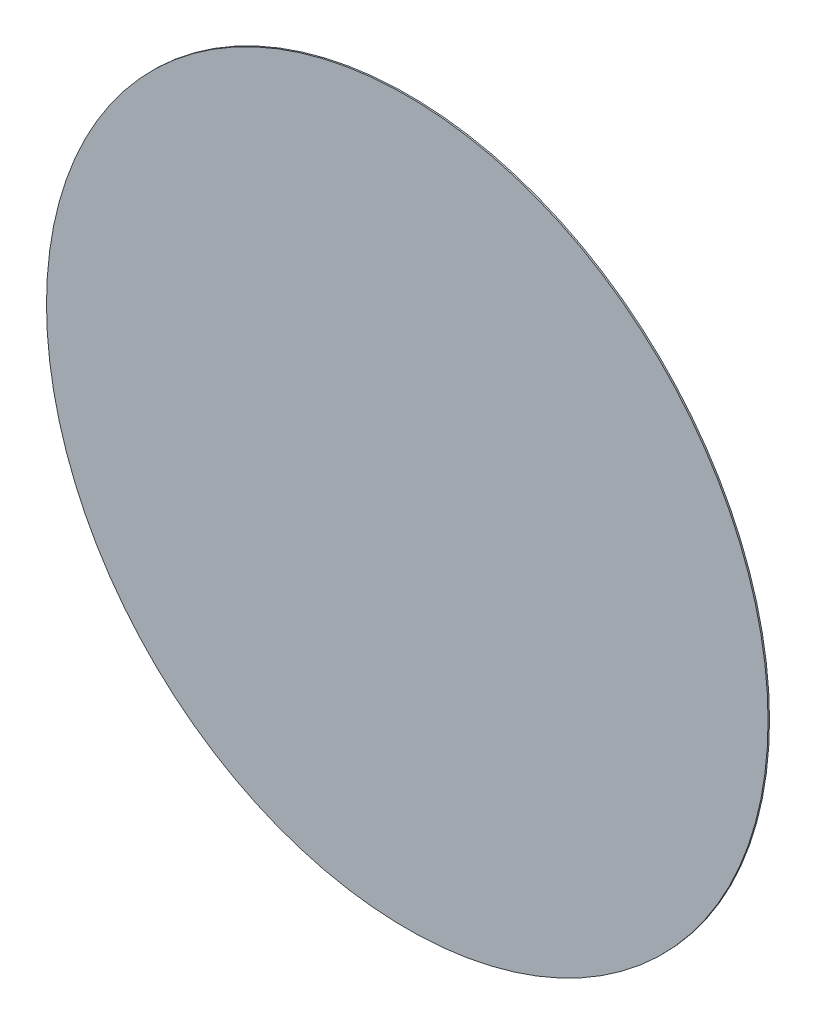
from build123d import *

# Parameters (mm, degrees)
SKETCH1_R      = 12.5
EXTRUDE1_DEPTH = 0.05


with BuildPart() as part:
    # Sketch1 → Extrude1 (new body)
    with BuildSketch(Plane.XY):
        Circle(SKETCH1_R)
    extrude(amount=EXTRUDE1_DEPTH)


solid = part.part
